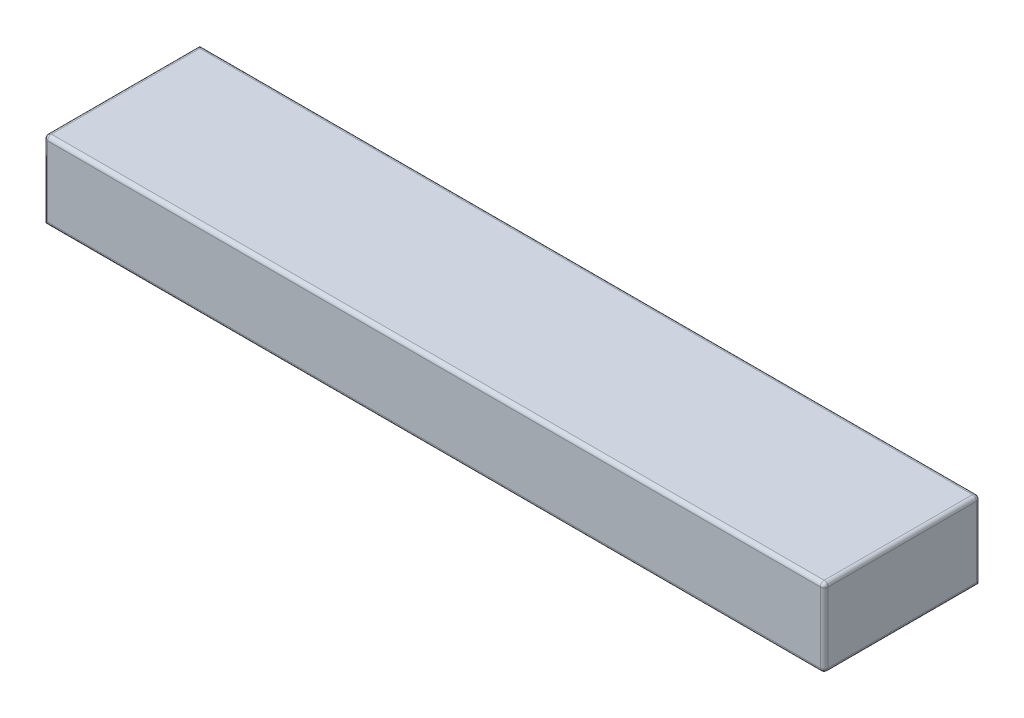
ISO-10303-21;
HEADER;
FILE_DESCRIPTION(('STEP AP214'),'2;1');
FILE_NAME('part.step','',(''),(''),'','','');
FILE_SCHEMA(('AUTOMOTIVE_DESIGN { 1 0 10303 214 1 1 1 1 }'));
ENDSEC;
DATA;
#1=APPLICATION_CONTEXT('core data for automotive mechanical design processes');
#2=APPLICATION_PROTOCOL_DEFINITION('international standard','automotive_design',2000,#1);
#3=PRODUCT_CONTEXT('',#1,'mechanical');
#4=PRODUCT('Part','Part','',(#3));
#5=PRODUCT_RELATED_PRODUCT_CATEGORY('part','',(#4));
#6=PRODUCT_DEFINITION_FORMATION('','',#4);
#7=PRODUCT_DEFINITION_CONTEXT('part definition',#1,'design');
#8=PRODUCT_DEFINITION('design','',#6,#7);
#9=PRODUCT_DEFINITION_SHAPE('','',#8);
#10=(LENGTH_UNIT() NAMED_UNIT(*) SI_UNIT(.MILLI.,.METRE.));
#11=(NAMED_UNIT(*) PLANE_ANGLE_UNIT() SI_UNIT($,.RADIAN.));
#12=(NAMED_UNIT(*) SI_UNIT($,.STERADIAN.) SOLID_ANGLE_UNIT());
#13=UNCERTAINTY_MEASURE_WITH_UNIT(LENGTH_MEASURE(1.E-05),#10,'distance_accuracy_value','');
#14=(GEOMETRIC_REPRESENTATION_CONTEXT(3) GLOBAL_UNCERTAINTY_ASSIGNED_CONTEXT((#13)) GLOBAL_UNIT_ASSIGNED_CONTEXT((#10,
#11,#12)) REPRESENTATION_CONTEXT('',''));
#15=CARTESIAN_POINT('',(0.,0.,0.));
#16=DIRECTION('',(0.,0.,1.));
#17=DIRECTION('',(1.,0.,0.));
#18=AXIS2_PLACEMENT_3D('',#15,#16,#17);
#19=CARTESIAN_POINT('',(0.,10.,0.));
#20=DIRECTION('',(1.,0.,0.));
#21=DIRECTION('',(0.,0.,-1.));
#22=AXIS2_PLACEMENT_3D('',#19,#20,#21);
#23=PLANE('',#22);
#24=DIRECTION('',(0.,-1.,0.));
#25=VECTOR('',#24,1.);
#26=CARTESIAN_POINT('',(0.,10.,19.5));
#27=LINE('',#26,#25);
#28=CARTESIAN_POINT('',(0.,0.,19.5));
#29=VERTEX_POINT('',#28);
#30=CARTESIAN_POINT('',(0.,9.5,19.5));
#31=VERTEX_POINT('',#30);
#32=EDGE_CURVE('E56',#29,#31,#27,.F.);
#33=ORIENTED_EDGE('',*,*,#32,.T.);
#34=DIRECTION('',(0.,0.,1.));
#35=VECTOR('',#34,1.);
#36=CARTESIAN_POINT('',(0.,9.5,0.));
#37=LINE('',#36,#35);
#38=CARTESIAN_POINT('',(0.,9.5,0.));
#39=VERTEX_POINT('',#38);
#40=EDGE_CURVE('E110',#31,#39,#37,.F.);
#41=ORIENTED_EDGE('',*,*,#40,.T.);
#42=DIRECTION('',(0.,-1.,0.));
#43=VECTOR('',#42,1.);
#44=CARTESIAN_POINT('',(0.,10.,0.));
#45=LINE('',#44,#43);
#46=CARTESIAN_POINT('',(0.,0.,0.));
#47=VERTEX_POINT('',#46);
#48=EDGE_CURVE('E106',#39,#47,#45,.T.);
#49=ORIENTED_EDGE('',*,*,#48,.T.);
#50=DIRECTION('',(0.,0.,1.));
#51=VECTOR('',#50,1.);
#52=CARTESIAN_POINT('',(0.,0.,0.));
#53=LINE('',#52,#51);
#54=EDGE_CURVE('E109',#47,#29,#53,.T.);
#55=ORIENTED_EDGE('',*,*,#54,.T.);
#56=EDGE_LOOP('',(#33,#41,#49,#55));
#57=FACE_BOUND('',#56,.T.);
#58=ADVANCED_FACE('F33',(#57),#23,.F.);
#59=CARTESIAN_POINT('',(0.,10.,20.));
#60=DIRECTION('',(0.,0.,-1.));
#61=DIRECTION('',(-1.,0.,0.));
#62=AXIS2_PLACEMENT_3D('',#59,#60,#61);
#63=PLANE('',#62);
#64=DIRECTION('',(1.,0.,0.));
#65=VECTOR('',#64,1.);
#66=CARTESIAN_POINT('',(0.,0.5,20.));
#67=LINE('',#66,#65);
#68=CARTESIAN_POINT('',(0.500000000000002,0.5,20.));
#69=VERTEX_POINT('',#68);
#70=CARTESIAN_POINT('',(99.5,0.5,20.));
#71=VERTEX_POINT('',#70);
#72=EDGE_CURVE('E131',#69,#71,#67,.T.);
#73=ORIENTED_EDGE('',*,*,#72,.T.);
#74=DIRECTION('',(0.,-1.,0.));
#75=VECTOR('',#74,1.);
#76=CARTESIAN_POINT('',(99.5,10.,20.));
#77=LINE('',#76,#75);
#78=CARTESIAN_POINT('',(99.5,9.5,20.));
#79=VERTEX_POINT('',#78);
#80=EDGE_CURVE('E134',#71,#79,#77,.F.);
#81=ORIENTED_EDGE('',*,*,#80,.T.);
#82=DIRECTION('',(1.,0.,0.));
#83=VECTOR('',#82,1.);
#84=CARTESIAN_POINT('',(0.,9.5,20.));
#85=LINE('',#84,#83);
#86=CARTESIAN_POINT('',(0.500000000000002,9.5,20.));
#87=VERTEX_POINT('',#86);
#88=EDGE_CURVE('E129',#79,#87,#85,.F.);
#89=ORIENTED_EDGE('',*,*,#88,.T.);
#90=DIRECTION('',(0.,-1.,0.));
#91=VECTOR('',#90,1.);
#92=CARTESIAN_POINT('',(0.500000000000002,10.,20.));
#93=LINE('',#92,#91);
#94=EDGE_CURVE('E111',#87,#69,#93,.T.);
#95=ORIENTED_EDGE('',*,*,#94,.T.);
#96=EDGE_LOOP('',(#73,#81,#89,#95));
#97=FACE_BOUND('',#96,.T.);
#98=ADVANCED_FACE('F235',(#97),#63,.F.);
#99=CARTESIAN_POINT('',(100.,10.,0.));
#100=DIRECTION('',(-1.,0.,0.));
#101=DIRECTION('',(0.,0.,1.));
#102=AXIS2_PLACEMENT_3D('',#99,#100,#101);
#103=PLANE('',#102);
#104=DIRECTION('',(0.,0.,-1.));
#105=VECTOR('',#104,1.);
#106=CARTESIAN_POINT('',(100.,0.5,0.));
#107=LINE('',#106,#105);
#108=CARTESIAN_POINT('',(100.,0.5,19.5));
#109=VERTEX_POINT('',#108);
#110=CARTESIAN_POINT('',(100.,0.5,0.5));
#111=VERTEX_POINT('',#110);
#112=EDGE_CURVE('E143',#109,#111,#107,.T.);
#113=ORIENTED_EDGE('',*,*,#112,.T.);
#114=DIRECTION('',(0.,-1.,0.));
#115=VECTOR('',#114,1.);
#116=CARTESIAN_POINT('',(100.,10.,0.5));
#117=LINE('',#116,#115);
#118=CARTESIAN_POINT('',(100.,9.5,0.5));
#119=VERTEX_POINT('',#118);
#120=EDGE_CURVE('E146',#111,#119,#117,.F.);
#121=ORIENTED_EDGE('',*,*,#120,.T.);
#122=DIRECTION('',(0.,0.,-1.));
#123=VECTOR('',#122,1.);
#124=CARTESIAN_POINT('',(100.,9.5,20.));
#125=LINE('',#124,#123);
#126=CARTESIAN_POINT('',(100.,9.5,19.5));
#127=VERTEX_POINT('',#126);
#128=EDGE_CURVE('E141',#119,#127,#125,.F.);
#129=ORIENTED_EDGE('',*,*,#128,.T.);
#130=DIRECTION('',(0.,-1.,0.));
#131=VECTOR('',#130,1.);
#132=CARTESIAN_POINT('',(100.,10.,19.5));
#133=LINE('',#132,#131);
#134=EDGE_CURVE('E139',#127,#109,#133,.T.);
#135=ORIENTED_EDGE('',*,*,#134,.T.);
#136=EDGE_LOOP('',(#113,#121,#129,#135));
#137=FACE_BOUND('',#136,.T.);
#138=ADVANCED_FACE('F212',(#137),#103,.F.);
#139=CARTESIAN_POINT('',(0.,10.,0.));
#140=DIRECTION('',(0.,0.,1.));
#141=DIRECTION('',(1.,0.,0.));
#142=AXIS2_PLACEMENT_3D('',#139,#140,#141);
#143=PLANE('',#142);
#144=ORIENTED_EDGE('',*,*,#48,.F.);
#145=DIRECTION('',(-1.,0.,0.));
#146=VECTOR('',#145,1.);
#147=CARTESIAN_POINT('',(100.,9.5,0.));
#148=LINE('',#147,#146);
#149=CARTESIAN_POINT('',(99.5,9.5,0.));
#150=VERTEX_POINT('',#149);
#151=EDGE_CURVE('E11',#39,#150,#148,.F.);
#152=ORIENTED_EDGE('',*,*,#151,.T.);
#153=DIRECTION('',(0.,-1.,0.));
#154=VECTOR('',#153,1.);
#155=CARTESIAN_POINT('',(99.5,10.,0.));
#156=LINE('',#155,#154);
#157=CARTESIAN_POINT('',(99.5,0.,0.));
#158=VERTEX_POINT('',#157);
#159=EDGE_CURVE('E42',#150,#158,#156,.T.);
#160=ORIENTED_EDGE('',*,*,#159,.T.);
#161=DIRECTION('',(-1.,0.,0.));
#162=VECTOR('',#161,1.);
#163=CARTESIAN_POINT('',(0.,0.,0.));
#164=LINE('',#163,#162);
#165=EDGE_CURVE('E112',#158,#47,#164,.T.);
#166=ORIENTED_EDGE('',*,*,#165,.T.);
#167=EDGE_LOOP('',(#144,#152,#160,#166));
#168=FACE_BOUND('',#167,.T.);
#169=ADVANCED_FACE('F115',(#168),#143,.F.);
#170=CARTESIAN_POINT('',(0.,10.,0.));
#171=DIRECTION('',(0.,1.,0.));
#172=DIRECTION('',(0.,0.,1.));
#173=AXIS2_PLACEMENT_3D('',#170,#171,#172);
#174=PLANE('',#173);
#175=DIRECTION('',(-1.,0.,0.));
#176=VECTOR('',#175,1.);
#177=CARTESIAN_POINT('',(0.,10.,0.5));
#178=LINE('',#177,#176);
#179=CARTESIAN_POINT('',(99.5,10.,0.5));
#180=VERTEX_POINT('',#179);
#181=CARTESIAN_POINT('',(0.5,10.,0.5));
#182=VERTEX_POINT('',#181);
#183=EDGE_CURVE('E148',#180,#182,#178,.T.);
#184=ORIENTED_EDGE('',*,*,#183,.T.);
#185=DIRECTION('',(0.,0.,1.));
#186=VECTOR('',#185,1.);
#187=CARTESIAN_POINT('',(0.500000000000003,10.,20.));
#188=LINE('',#187,#186);
#189=CARTESIAN_POINT('',(0.500000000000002,10.,19.5));
#190=VERTEX_POINT('',#189);
#191=EDGE_CURVE('E154',#182,#190,#188,.T.);
#192=ORIENTED_EDGE('',*,*,#191,.T.);
#193=DIRECTION('',(1.,0.,0.));
#194=VECTOR('',#193,1.);
#195=CARTESIAN_POINT('',(100.,10.,19.5));
#196=LINE('',#195,#194);
#197=CARTESIAN_POINT('',(99.5,10.,19.5));
#198=VERTEX_POINT('',#197);
#199=EDGE_CURVE('E152',#190,#198,#196,.T.);
#200=ORIENTED_EDGE('',*,*,#199,.T.);
#201=DIRECTION('',(0.,0.,-1.));
#202=VECTOR('',#201,1.);
#203=CARTESIAN_POINT('',(99.5,10.,0.));
#204=LINE('',#203,#202);
#205=EDGE_CURVE('E150',#198,#180,#204,.T.);
#206=ORIENTED_EDGE('',*,*,#205,.T.);
#207=EDGE_LOOP('',(#184,#192,#200,#206));
#208=FACE_BOUND('',#207,.T.);
#209=ADVANCED_FACE('F249',(#208),#174,.T.);
#210=CARTESIAN_POINT('',(0.,0.,0.));
#211=DIRECTION('',(0.,1.,0.));
#212=DIRECTION('',(0.,0.,1.));
#213=AXIS2_PLACEMENT_3D('',#210,#211,#212);
#214=PLANE('',#213);
#215=DIRECTION('',(0.,0.,-1.));
#216=VECTOR('',#215,1.);
#217=CARTESIAN_POINT('',(99.5,0.,0.));
#218=LINE('',#217,#216);
#219=CARTESIAN_POINT('',(99.5,0.,19.5));
#220=VERTEX_POINT('',#219);
#221=EDGE_CURVE('E136',#158,#220,#218,.F.);
#222=ORIENTED_EDGE('',*,*,#221,.T.);
#223=DIRECTION('',(1.,0.,0.));
#224=VECTOR('',#223,1.);
#225=CARTESIAN_POINT('',(0.,0.,19.5));
#226=LINE('',#225,#224);
#227=EDGE_CURVE('E123',#220,#29,#226,.F.);
#228=ORIENTED_EDGE('',*,*,#227,.T.);
#229=ORIENTED_EDGE('',*,*,#54,.F.);
#230=ORIENTED_EDGE('',*,*,#165,.F.);
#231=EDGE_LOOP('',(#222,#228,#229,#230));
#232=FACE_BOUND('',#231,.T.);
#233=ADVANCED_FACE('F121',(#232),#214,.F.);
#234=CARTESIAN_POINT('',(0.,9.5,0.5));
#235=DIRECTION('',(1.,0.,0.));
#236=DIRECTION('',(0.,0.,-1.));
#237=AXIS2_PLACEMENT_3D('',#234,#235,#236);
#238=CYLINDRICAL_SURFACE('',#237,0.5);
#239=CARTESIAN_POINT('',(0.5,9.5,0.5));
#240=DIRECTION('',(0.707106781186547,0.,-0.707106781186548));
#241=DIRECTION('',(0.707106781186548,0.,0.707106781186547));
#242=AXIS2_PLACEMENT_3D('',#239,#240,#241);
#243=ELLIPSE('',#242,0.707106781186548,0.5);
#244=EDGE_CURVE('E192',#182,#39,#243,.F.);
#245=ORIENTED_EDGE('',*,*,#244,.F.);
#246=ORIENTED_EDGE('',*,*,#183,.F.);
#247=CARTESIAN_POINT('',(99.5,9.5,0.5));
#248=DIRECTION('',(1.,0.,0.));
#249=DIRECTION('',(0.,0.,-1.));
#250=AXIS2_PLACEMENT_3D('',#247,#248,#249);
#251=CIRCLE('',#250,0.5);
#252=EDGE_CURVE('E126',#150,#180,#251,.T.);
#253=ORIENTED_EDGE('',*,*,#252,.F.);
#254=ORIENTED_EDGE('',*,*,#151,.F.);
#255=EDGE_LOOP('',(#245,#246,#253,#254));
#256=FACE_BOUND('',#255,.T.);
#257=ADVANCED_FACE('F35',(#256),#238,.T.);
#258=CARTESIAN_POINT('',(99.5,9.5,0.));
#259=DIRECTION('',(0.,0.,1.));
#260=DIRECTION('',(1.,0.,0.));
#261=AXIS2_PLACEMENT_3D('',#258,#259,#260);
#262=CYLINDRICAL_SURFACE('',#261,0.5);
#263=CARTESIAN_POINT('',(99.5,9.5,0.5));
#264=DIRECTION('',(0.,0.,-1.));
#265=DIRECTION('',(-1.,0.,0.));
#266=AXIS2_PLACEMENT_3D('',#263,#264,#265);
#267=CIRCLE('',#266,0.5);
#268=EDGE_CURVE('E37',#180,#119,#267,.T.);
#269=ORIENTED_EDGE('',*,*,#268,.F.);
#270=ORIENTED_EDGE('',*,*,#205,.F.);
#271=CARTESIAN_POINT('',(99.5,9.5,19.5));
#272=DIRECTION('',(0.,0.,1.));
#273=DIRECTION('',(1.,0.,0.));
#274=AXIS2_PLACEMENT_3D('',#271,#272,#273);
#275=CIRCLE('',#274,0.5);
#276=EDGE_CURVE('E186',#127,#198,#275,.T.);
#277=ORIENTED_EDGE('',*,*,#276,.F.);
#278=ORIENTED_EDGE('',*,*,#128,.F.);
#279=EDGE_LOOP('',(#269,#270,#277,#278));
#280=FACE_BOUND('',#279,.T.);
#281=ADVANCED_FACE('F207',(#280),#262,.T.);
#282=CARTESIAN_POINT('',(99.5,9.5,0.5));
#283=DIRECTION('',(0.,0.,1.));
#284=DIRECTION('',(1.,0.,0.));
#285=AXIS2_PLACEMENT_3D('',#282,#283,#284);
#286=SPHERICAL_SURFACE('',#285,0.5);
#287=ORIENTED_EDGE('',*,*,#252,.T.);
#288=ORIENTED_EDGE('',*,*,#268,.T.);
#289=CARTESIAN_POINT('',(99.5,9.5,0.5));
#290=DIRECTION('',(0.,1.,0.));
#291=DIRECTION('',(0.,0.,1.));
#292=AXIS2_PLACEMENT_3D('',#289,#290,#291);
#293=CIRCLE('',#292,0.5);
#294=EDGE_CURVE('E183',#150,#119,#293,.F.);
#295=ORIENTED_EDGE('',*,*,#294,.F.);
#296=EDGE_LOOP('',(#287,#288,#295));
#297=FACE_BOUND('',#296,.T.);
#298=ADVANCED_FACE('F197',(#297),#286,.T.);
#299=CARTESIAN_POINT('',(0.5,9.5,0.));
#300=DIRECTION('',(0.,0.,-1.));
#301=DIRECTION('',(-1.,0.,0.));
#302=AXIS2_PLACEMENT_3D('',#299,#300,#301);
#303=CYLINDRICAL_SURFACE('',#302,0.5);
#304=ORIENTED_EDGE('',*,*,#244,.T.);
#305=ORIENTED_EDGE('',*,*,#40,.F.);
#306=CARTESIAN_POINT('',(0.500000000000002,9.5,19.5));
#307=DIRECTION('',(0.,0.,1.));
#308=DIRECTION('',(1.,0.,0.));
#309=AXIS2_PLACEMENT_3D('',#306,#307,#308);
#310=CIRCLE('',#309,0.5);
#311=EDGE_CURVE('E180',#190,#31,#310,.T.);
#312=ORIENTED_EDGE('',*,*,#311,.F.);
#313=ORIENTED_EDGE('',*,*,#191,.F.);
#314=EDGE_LOOP('',(#304,#305,#312,#313));
#315=FACE_BOUND('',#314,.T.);
#316=ADVANCED_FACE('F246',(#315),#303,.T.);
#317=CARTESIAN_POINT('',(0.,9.5,19.5));
#318=DIRECTION('',(-1.,0.,0.));
#319=DIRECTION('',(0.,0.,1.));
#320=AXIS2_PLACEMENT_3D('',#317,#318,#319);
#321=CYLINDRICAL_SURFACE('',#320,0.5);
#322=CARTESIAN_POINT('',(99.5,9.5,19.5));
#323=DIRECTION('',(1.,0.,0.));
#324=DIRECTION('',(0.,0.,-1.));
#325=AXIS2_PLACEMENT_3D('',#322,#323,#324);
#326=CIRCLE('',#325,0.5);
#327=EDGE_CURVE('E189',#198,#79,#326,.T.);
#328=ORIENTED_EDGE('',*,*,#327,.F.);
#329=ORIENTED_EDGE('',*,*,#199,.F.);
#330=CARTESIAN_POINT('',(0.500000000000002,9.5,19.5));
#331=DIRECTION('',(-1.,0.,0.));
#332=DIRECTION('',(0.,0.,1.));
#333=AXIS2_PLACEMENT_3D('',#330,#331,#332);
#334=CIRCLE('',#333,0.5);
#335=EDGE_CURVE('E178',#87,#190,#334,.T.);
#336=ORIENTED_EDGE('',*,*,#335,.F.);
#337=ORIENTED_EDGE('',*,*,#88,.F.);
#338=EDGE_LOOP('',(#328,#329,#336,#337));
#339=FACE_BOUND('',#338,.T.);
#340=ADVANCED_FACE('F248',(#339),#321,.T.);
#341=CARTESIAN_POINT('',(99.5,9.5,19.5));
#342=DIRECTION('',(0.,0.,1.));
#343=DIRECTION('',(1.,0.,0.));
#344=AXIS2_PLACEMENT_3D('',#341,#342,#343);
#345=SPHERICAL_SURFACE('',#344,0.5);
#346=ORIENTED_EDGE('',*,*,#276,.T.);
#347=ORIENTED_EDGE('',*,*,#327,.T.);
#348=CARTESIAN_POINT('',(99.5,9.5,19.5));
#349=DIRECTION('',(0.,1.,0.));
#350=DIRECTION('',(0.,0.,1.));
#351=AXIS2_PLACEMENT_3D('',#348,#349,#350);
#352=CIRCLE('',#351,0.5);
#353=EDGE_CURVE('E175',#127,#79,#352,.F.);
#354=ORIENTED_EDGE('',*,*,#353,.F.);
#355=EDGE_LOOP('',(#346,#347,#354));
#356=FACE_BOUND('',#355,.T.);
#357=ADVANCED_FACE('F280',(#356),#345,.T.);
#358=CARTESIAN_POINT('',(99.5,10.,0.5));
#359=DIRECTION('',(0.,-1.,0.));
#360=DIRECTION('',(0.,0.,-1.));
#361=AXIS2_PLACEMENT_3D('',#358,#359,#360);
#362=CYLINDRICAL_SURFACE('',#361,0.5);
#363=ORIENTED_EDGE('',*,*,#294,.T.);
#364=ORIENTED_EDGE('',*,*,#120,.F.);
#365=CARTESIAN_POINT('',(99.5,0.5,0.5));
#366=DIRECTION('',(0.,-0.707106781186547,0.707106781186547));
#367=DIRECTION('',(0.,-0.707106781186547,-0.707106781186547));
#368=AXIS2_PLACEMENT_3D('',#365,#366,#367);
#369=ELLIPSE('',#368,0.707106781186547,0.5);
#370=EDGE_CURVE('E173',#158,#111,#369,.T.);
#371=ORIENTED_EDGE('',*,*,#370,.F.);
#372=ORIENTED_EDGE('',*,*,#159,.F.);
#373=EDGE_LOOP('',(#363,#364,#371,#372));
#374=FACE_BOUND('',#373,.T.);
#375=ADVANCED_FACE('F217',(#374),#362,.T.);
#376=CARTESIAN_POINT('',(0.500000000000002,9.5,19.5));
#377=DIRECTION('',(0.,0.,1.));
#378=DIRECTION('',(1.,0.,0.));
#379=AXIS2_PLACEMENT_3D('',#376,#377,#378);
#380=SPHERICAL_SURFACE('',#379,0.5);
#381=ORIENTED_EDGE('',*,*,#335,.T.);
#382=ORIENTED_EDGE('',*,*,#311,.T.);
#383=CARTESIAN_POINT('',(0.500000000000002,9.5,19.5));
#384=DIRECTION('',(0.,1.,0.));
#385=DIRECTION('',(0.,0.,1.));
#386=AXIS2_PLACEMENT_3D('',#383,#384,#385);
#387=CIRCLE('',#386,0.5);
#388=EDGE_CURVE('E170',#87,#31,#387,.F.);
#389=ORIENTED_EDGE('',*,*,#388,.F.);
#390=EDGE_LOOP('',(#381,#382,#389));
#391=FACE_BOUND('',#390,.T.);
#392=ADVANCED_FACE('F242',(#391),#380,.T.);
#393=CARTESIAN_POINT('',(99.5,10.,19.5));
#394=DIRECTION('',(0.,-1.,0.));
#395=DIRECTION('',(0.,0.,-1.));
#396=AXIS2_PLACEMENT_3D('',#393,#394,#395);
#397=CYLINDRICAL_SURFACE('',#396,0.5);
#398=ORIENTED_EDGE('',*,*,#353,.T.);
#399=ORIENTED_EDGE('',*,*,#80,.F.);
#400=CARTESIAN_POINT('',(99.5,0.5,19.5));
#401=DIRECTION('',(0.,-1.,0.));
#402=DIRECTION('',(0.,0.,-1.));
#403=AXIS2_PLACEMENT_3D('',#400,#401,#402);
#404=CIRCLE('',#403,0.5);
#405=EDGE_CURVE('E167',#109,#71,#404,.T.);
#406=ORIENTED_EDGE('',*,*,#405,.F.);
#407=ORIENTED_EDGE('',*,*,#134,.F.);
#408=EDGE_LOOP('',(#398,#399,#406,#407));
#409=FACE_BOUND('',#408,.T.);
#410=ADVANCED_FACE('F232',(#409),#397,.T.);
#411=CARTESIAN_POINT('',(99.5,0.5,0.));
#412=DIRECTION('',(0.,0.,-1.));
#413=DIRECTION('',(-1.,0.,0.));
#414=AXIS2_PLACEMENT_3D('',#411,#412,#413);
#415=CYLINDRICAL_SURFACE('',#414,0.5);
#416=ORIENTED_EDGE('',*,*,#370,.T.);
#417=ORIENTED_EDGE('',*,*,#112,.F.);
#418=CARTESIAN_POINT('',(99.5,0.5,19.5));
#419=DIRECTION('',(0.,0.,1.));
#420=DIRECTION('',(1.,0.,0.));
#421=AXIS2_PLACEMENT_3D('',#418,#419,#420);
#422=CIRCLE('',#421,0.5);
#423=EDGE_CURVE('E164',#220,#109,#422,.T.);
#424=ORIENTED_EDGE('',*,*,#423,.F.);
#425=ORIENTED_EDGE('',*,*,#221,.F.);
#426=EDGE_LOOP('',(#416,#417,#424,#425));
#427=FACE_BOUND('',#426,.T.);
#428=ADVANCED_FACE('F221',(#427),#415,.T.);
#429=CARTESIAN_POINT('',(0.500000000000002,10.,19.5));
#430=DIRECTION('',(0.,-1.,0.));
#431=DIRECTION('',(0.,0.,-1.));
#432=AXIS2_PLACEMENT_3D('',#429,#430,#431);
#433=CYLINDRICAL_SURFACE('',#432,0.5);
#434=ORIENTED_EDGE('',*,*,#388,.T.);
#435=ORIENTED_EDGE('',*,*,#32,.F.);
#436=CARTESIAN_POINT('',(0.500000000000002,0.5,19.5));
#437=DIRECTION('',(0.707106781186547,-0.707106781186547,0.));
#438=DIRECTION('',(-0.707106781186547,-0.707106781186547,0.));
#439=AXIS2_PLACEMENT_3D('',#436,#437,#438);
#440=ELLIPSE('',#439,0.707106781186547,0.5);
#441=EDGE_CURVE('E162',#69,#29,#440,.T.);
#442=ORIENTED_EDGE('',*,*,#441,.F.);
#443=ORIENTED_EDGE('',*,*,#94,.F.);
#444=EDGE_LOOP('',(#434,#435,#442,#443));
#445=FACE_BOUND('',#444,.T.);
#446=ADVANCED_FACE('F239',(#445),#433,.T.);
#447=CARTESIAN_POINT('',(99.5,0.5,19.5));
#448=DIRECTION('',(0.,0.,1.));
#449=DIRECTION('',(1.,0.,0.));
#450=AXIS2_PLACEMENT_3D('',#447,#448,#449);
#451=SPHERICAL_SURFACE('',#450,0.5);
#452=ORIENTED_EDGE('',*,*,#423,.T.);
#453=ORIENTED_EDGE('',*,*,#405,.T.);
#454=CARTESIAN_POINT('',(99.5,0.5,19.5));
#455=DIRECTION('',(1.,0.,0.));
#456=DIRECTION('',(0.,0.,-1.));
#457=AXIS2_PLACEMENT_3D('',#454,#455,#456);
#458=CIRCLE('',#457,0.5);
#459=EDGE_CURVE('E160',#220,#71,#458,.F.);
#460=ORIENTED_EDGE('',*,*,#459,.F.);
#461=EDGE_LOOP('',(#452,#453,#460));
#462=FACE_BOUND('',#461,.T.);
#463=ADVANCED_FACE('F229',(#462),#451,.T.);
#464=CARTESIAN_POINT('',(0.,0.5,19.5));
#465=DIRECTION('',(1.,0.,0.));
#466=DIRECTION('',(0.,0.,-1.));
#467=AXIS2_PLACEMENT_3D('',#464,#465,#466);
#468=CYLINDRICAL_SURFACE('',#467,0.5);
#469=ORIENTED_EDGE('',*,*,#441,.T.);
#470=ORIENTED_EDGE('',*,*,#227,.F.);
#471=ORIENTED_EDGE('',*,*,#459,.T.);
#472=ORIENTED_EDGE('',*,*,#72,.F.);
#473=EDGE_LOOP('',(#469,#470,#471,#472));
#474=FACE_BOUND('',#473,.T.);
#475=ADVANCED_FACE('F226',(#474),#468,.T.);
#476=CLOSED_SHELL('',(#58,#98,#138,#169,#209,#233,#257,#281,#298,#316,#340,#357,#375,#392,#410,
#428,#446,#463,#475));
#477=MANIFOLD_SOLID_BREP('B2',#476);
#478=ADVANCED_BREP_SHAPE_REPRESENTATION('',(#18,#477),#14);
#479=SHAPE_DEFINITION_REPRESENTATION(#9,#478);
ENDSEC;
END-ISO-10303-21;
